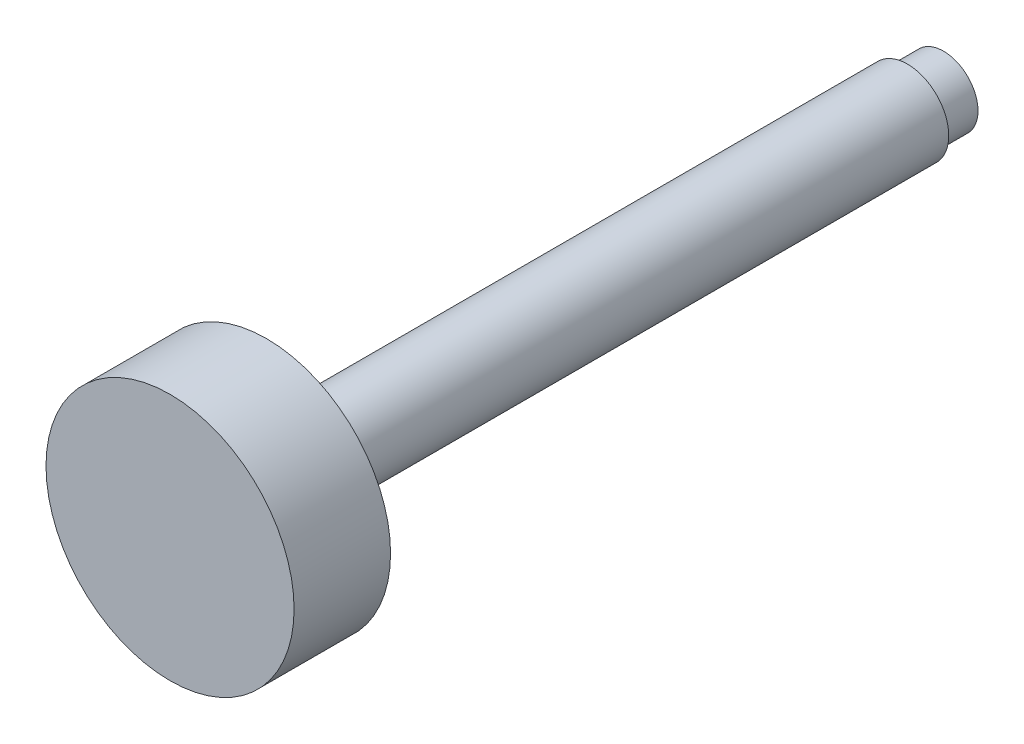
ISO-10303-21;
HEADER;
FILE_DESCRIPTION(('STEP AP214'),'2;1');
FILE_NAME('part.step','',(''),(''),'','','');
FILE_SCHEMA(('AUTOMOTIVE_DESIGN { 1 0 10303 214 1 1 1 1 }'));
ENDSEC;
DATA;
#1=APPLICATION_CONTEXT('core data for automotive mechanical design processes');
#2=APPLICATION_PROTOCOL_DEFINITION('international standard','automotive_design',2000,#1);
#3=PRODUCT_CONTEXT('',#1,'mechanical');
#4=PRODUCT('Part','Part','',(#3));
#5=PRODUCT_RELATED_PRODUCT_CATEGORY('part','',(#4));
#6=PRODUCT_DEFINITION_FORMATION('','',#4);
#7=PRODUCT_DEFINITION_CONTEXT('part definition',#1,'design');
#8=PRODUCT_DEFINITION('design','',#6,#7);
#9=PRODUCT_DEFINITION_SHAPE('','',#8);
#10=(LENGTH_UNIT() NAMED_UNIT(*) SI_UNIT(.MILLI.,.METRE.));
#11=(NAMED_UNIT(*) PLANE_ANGLE_UNIT() SI_UNIT($,.RADIAN.));
#12=(NAMED_UNIT(*) SI_UNIT($,.STERADIAN.) SOLID_ANGLE_UNIT());
#13=UNCERTAINTY_MEASURE_WITH_UNIT(LENGTH_MEASURE(1.E-05),#10,'distance_accuracy_value','');
#14=(GEOMETRIC_REPRESENTATION_CONTEXT(3) GLOBAL_UNCERTAINTY_ASSIGNED_CONTEXT((#13)) GLOBAL_UNIT_ASSIGNED_CONTEXT((#10,
#11,#12)) REPRESENTATION_CONTEXT('',''));
#15=CARTESIAN_POINT('',(0.,0.,0.));
#16=DIRECTION('',(0.,0.,1.));
#17=DIRECTION('',(1.,0.,0.));
#18=AXIS2_PLACEMENT_3D('',#15,#16,#17);
#19=CARTESIAN_POINT('',(0.,0.,4.));
#20=DIRECTION('',(0.,0.,1.));
#21=DIRECTION('',(1.,0.,0.));
#22=AXIS2_PLACEMENT_3D('',#19,#20,#21);
#23=SPHERICAL_SURFACE('',#22,4.);
#24=CARTESIAN_POINT('',(0.,0.,0.8775010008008));
#25=DIRECTION('',(0.,0.,1.));
#26=DIRECTION('',(1.,0.,0.));
#27=AXIS2_PLACEMENT_3D('',#24,#25,#26);
#28=CIRCLE('',#27,2.5);
#29=CARTESIAN_POINT('',(2.5,0.,0.8775010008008));
#30=VERTEX_POINT('',#29);
#31=EDGE_CURVE('E8',#30,#30,#28,.T.);
#32=ORIENTED_EDGE('',*,*,#31,.F.);
#33=EDGE_LOOP('',(#32));
#34=FACE_BOUND('',#33,.T.);
#35=ADVANCED_FACE('F12',(#34),#23,.T.);
#36=CARTESIAN_POINT('',(0.,0.,40.017563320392));
#37=DIRECTION('',(0.,0.,1.));
#38=DIRECTION('',(1.,0.,0.));
#39=AXIS2_PLACEMENT_3D('',#36,#37,#38);
#40=CYLINDRICAL_SURFACE('',#39,2.5);
#41=CARTESIAN_POINT('',(0.,0.,3.5));
#42=DIRECTION('',(0.,0.,1.));
#43=DIRECTION('',(1.,0.,0.));
#44=AXIS2_PLACEMENT_3D('',#41,#42,#43);
#45=CIRCLE('',#44,2.5);
#46=CARTESIAN_POINT('',(2.5,0.,3.5));
#47=VERTEX_POINT('',#46);
#48=EDGE_CURVE('E18',#47,#47,#45,.T.);
#49=ORIENTED_EDGE('',*,*,#48,.F.);
#50=EDGE_LOOP('',(#49));
#51=FACE_BOUND('',#50,.T.);
#52=ORIENTED_EDGE('',*,*,#31,.T.);
#53=EDGE_LOOP('',(#52));
#54=FACE_BOUND('',#53,.T.);
#55=ADVANCED_FACE('F60',(#51,#54),#40,.T.);
#56=CARTESIAN_POINT('',(-2.5,0.,3.5));
#57=DIRECTION('',(0.,0.,1.));
#58=DIRECTION('',(1.,0.,0.));
#59=AXIS2_PLACEMENT_3D('',#56,#57,#58);
#60=PLANE('',#59);
#61=CARTESIAN_POINT('',(0.,0.,3.5));
#62=DIRECTION('',(0.,0.,1.));
#63=DIRECTION('',(1.,0.,0.));
#64=AXIS2_PLACEMENT_3D('',#61,#62,#63);
#65=CIRCLE('',#64,3.);
#66=CARTESIAN_POINT('',(3.,0.,3.5));
#67=VERTEX_POINT('',#66);
#68=EDGE_CURVE('E22',#67,#67,#65,.T.);
#69=ORIENTED_EDGE('',*,*,#68,.F.);
#70=EDGE_LOOP('',(#69));
#71=FACE_BOUND('',#70,.T.);
#72=ORIENTED_EDGE('',*,*,#48,.T.);
#73=EDGE_LOOP('',(#72));
#74=FACE_BOUND('',#73,.T.);
#75=ADVANCED_FACE('F55',(#71,#74),#60,.F.);
#76=CARTESIAN_POINT('',(0.,0.,40.017563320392));
#77=DIRECTION('',(0.,0.,1.));
#78=DIRECTION('',(1.,0.,0.));
#79=AXIS2_PLACEMENT_3D('',#76,#77,#78);
#80=CYLINDRICAL_SURFACE('',#79,3.);
#81=CARTESIAN_POINT('',(0.,0.,50.));
#82=DIRECTION('',(0.,0.,1.));
#83=DIRECTION('',(1.,0.,0.));
#84=AXIS2_PLACEMENT_3D('',#81,#82,#83);
#85=CIRCLE('',#84,3.);
#86=CARTESIAN_POINT('',(3.,0.,50.));
#87=VERTEX_POINT('',#86);
#88=EDGE_CURVE('E26',#87,#87,#85,.T.);
#89=ORIENTED_EDGE('',*,*,#88,.F.);
#90=EDGE_LOOP('',(#89));
#91=FACE_BOUND('',#90,.T.);
#92=ORIENTED_EDGE('',*,*,#68,.T.);
#93=EDGE_LOOP('',(#92));
#94=FACE_BOUND('',#93,.T.);
#95=ADVANCED_FACE('F49',(#91,#94),#80,.T.);
#96=CARTESIAN_POINT('',(-3.,0.,50.));
#97=DIRECTION('',(0.,0.,1.));
#98=DIRECTION('',(1.,0.,0.));
#99=AXIS2_PLACEMENT_3D('',#96,#97,#98);
#100=PLANE('',#99);
#101=CARTESIAN_POINT('',(0.,0.,50.));
#102=DIRECTION('',(0.,0.,1.));
#103=DIRECTION('',(1.,0.,0.));
#104=AXIS2_PLACEMENT_3D('',#101,#102,#103);
#105=CIRCLE('',#104,9.);
#106=CARTESIAN_POINT('',(9.,0.,50.));
#107=VERTEX_POINT('',#106);
#108=EDGE_CURVE('E31',#107,#107,#105,.T.);
#109=ORIENTED_EDGE('',*,*,#108,.F.);
#110=EDGE_LOOP('',(#109));
#111=FACE_BOUND('',#110,.T.);
#112=ORIENTED_EDGE('',*,*,#88,.T.);
#113=EDGE_LOOP('',(#112));
#114=FACE_BOUND('',#113,.T.);
#115=ADVANCED_FACE('F43',(#111,#114),#100,.F.);
#116=CARTESIAN_POINT('',(0.,0.,40.017563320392));
#117=DIRECTION('',(0.,0.,1.));
#118=DIRECTION('',(1.,0.,0.));
#119=AXIS2_PLACEMENT_3D('',#116,#117,#118);
#120=CYLINDRICAL_SURFACE('',#119,9.);
#121=CARTESIAN_POINT('',(0.,0.,57.));
#122=DIRECTION('',(0.,0.,1.));
#123=DIRECTION('',(1.,0.,0.));
#124=AXIS2_PLACEMENT_3D('',#121,#122,#123);
#125=CIRCLE('',#124,9.);
#126=CARTESIAN_POINT('',(9.,0.,57.));
#127=VERTEX_POINT('',#126);
#128=EDGE_CURVE('E34',#127,#127,#125,.T.);
#129=ORIENTED_EDGE('',*,*,#128,.F.);
#130=EDGE_LOOP('',(#129));
#131=FACE_BOUND('',#130,.T.);
#132=ORIENTED_EDGE('',*,*,#108,.T.);
#133=EDGE_LOOP('',(#132));
#134=FACE_BOUND('',#133,.T.);
#135=ADVANCED_FACE('F40',(#131,#134),#120,.T.);
#136=CARTESIAN_POINT('',(-9.,0.,57.));
#137=DIRECTION('',(0.,0.,-1.));
#138=DIRECTION('',(-1.,0.,0.));
#139=AXIS2_PLACEMENT_3D('',#136,#137,#138);
#140=PLANE('',#139);
#141=ORIENTED_EDGE('',*,*,#128,.T.);
#142=EDGE_LOOP('',(#141));
#143=FACE_BOUND('',#142,.T.);
#144=ADVANCED_FACE('F38',(#143),#140,.F.);
#145=CLOSED_SHELL('',(#35,#55,#75,#95,#115,#135,#144));
#146=MANIFOLD_SOLID_BREP('B1',#145);
#147=ADVANCED_BREP_SHAPE_REPRESENTATION('',(#18,#146),#14);
#148=SHAPE_DEFINITION_REPRESENTATION(#9,#147);
ENDSEC;
END-ISO-10303-21;
